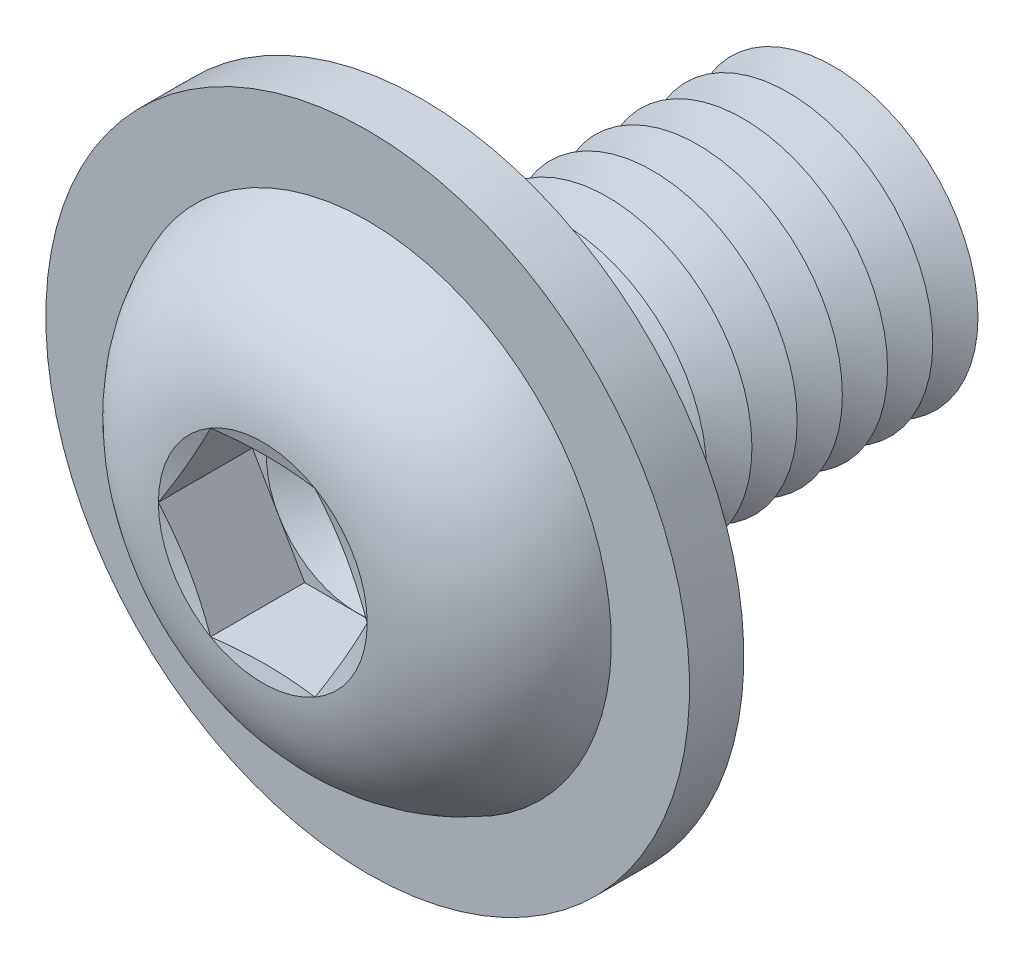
ISO-10303-21;
HEADER;
FILE_DESCRIPTION(('STEP AP214'),'2;1');
FILE_NAME('part.step','',(''),(''),'','','');
FILE_SCHEMA(('AUTOMOTIVE_DESIGN { 1 0 10303 214 1 1 1 1 }'));
ENDSEC;
DATA;
#1=APPLICATION_CONTEXT('core data for automotive mechanical design processes');
#2=APPLICATION_PROTOCOL_DEFINITION('international standard','automotive_design',2000,#1);
#3=PRODUCT_CONTEXT('',#1,'mechanical');
#4=PRODUCT('Part','Part','',(#3));
#5=PRODUCT_RELATED_PRODUCT_CATEGORY('part','',(#4));
#6=PRODUCT_DEFINITION_FORMATION('','',#4);
#7=PRODUCT_DEFINITION_CONTEXT('part definition',#1,'design');
#8=PRODUCT_DEFINITION('design','',#6,#7);
#9=PRODUCT_DEFINITION_SHAPE('','',#8);
#10=(LENGTH_UNIT() NAMED_UNIT(*) SI_UNIT(.MILLI.,.METRE.));
#11=(NAMED_UNIT(*) PLANE_ANGLE_UNIT() SI_UNIT($,.RADIAN.));
#12=(NAMED_UNIT(*) SI_UNIT($,.STERADIAN.) SOLID_ANGLE_UNIT());
#13=UNCERTAINTY_MEASURE_WITH_UNIT(LENGTH_MEASURE(1.E-05),#10,'distance_accuracy_value','');
#14=(GEOMETRIC_REPRESENTATION_CONTEXT(3) GLOBAL_UNCERTAINTY_ASSIGNED_CONTEXT((#13)) GLOBAL_UNIT_ASSIGNED_CONTEXT((#10,
#11,#12)) REPRESENTATION_CONTEXT('',''));
#15=CARTESIAN_POINT('',(0.,0.,0.));
#16=DIRECTION('',(0.,0.,1.));
#17=DIRECTION('',(1.,0.,0.));
#18=AXIS2_PLACEMENT_3D('',#15,#16,#17);
#19=CARTESIAN_POINT('',(0.,0.,-7.625));
#20=DIRECTION('',(0.,0.,1.));
#21=DIRECTION('',(1.,0.,0.));
#22=AXIS2_PLACEMENT_3D('',#19,#20,#21);
#23=CONICAL_SURFACE('',#22,4.,1.0471975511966);
#24=CARTESIAN_POINT('',(0.,0.,-8.25));
#25=DIRECTION('',(0.,0.,1.));
#26=DIRECTION('',(1.,0.,0.));
#27=AXIS2_PLACEMENT_3D('',#24,#25,#26);
#28=CIRCLE('',#27,2.91746824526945);
#29=CARTESIAN_POINT('',(2.91746824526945,0.,-8.25));
#30=VERTEX_POINT('',#29);
#31=EDGE_CURVE('E282',#30,#30,#28,.T.);
#32=ORIENTED_EDGE('',*,*,#31,.T.);
#33=EDGE_LOOP('',(#32));
#34=FACE_BOUND('',#33,.T.);
#35=CARTESIAN_POINT('',(0.,0.,-7.625));
#36=DIRECTION('',(0.,0.,1.));
#37=DIRECTION('',(1.,0.,0.));
#38=AXIS2_PLACEMENT_3D('',#35,#36,#37);
#39=CIRCLE('',#38,4.);
#40=CARTESIAN_POINT('',(4.,0.,-7.625));
#41=VERTEX_POINT('',#40);
#42=EDGE_CURVE('E278',#41,#41,#39,.T.);
#43=ORIENTED_EDGE('',*,*,#42,.F.);
#44=EDGE_LOOP('',(#43));
#45=FACE_BOUND('',#44,.T.);
#46=ADVANCED_FACE('F39',(#34,#45),#23,.T.);
#47=CARTESIAN_POINT('',(0.,0.,-8.25));
#48=DIRECTION('',(0.,0.,-1.));
#49=DIRECTION('',(-1.,0.,0.));
#50=AXIS2_PLACEMENT_3D('',#47,#48,#49);
#51=CONICAL_SURFACE('',#50,2.91746824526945,1.0471975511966);
#52=CARTESIAN_POINT('',(0.,0.,-8.875));
#53=DIRECTION('',(0.,0.,1.));
#54=DIRECTION('',(1.,0.,0.));
#55=AXIS2_PLACEMENT_3D('',#52,#53,#54);
#56=CIRCLE('',#55,4.);
#57=CARTESIAN_POINT('',(4.,0.,-8.875));
#58=VERTEX_POINT('',#57);
#59=EDGE_CURVE('E286',#58,#58,#56,.T.);
#60=ORIENTED_EDGE('',*,*,#59,.T.);
#61=EDGE_LOOP('',(#60));
#62=FACE_BOUND('',#61,.T.);
#63=ORIENTED_EDGE('',*,*,#31,.F.);
#64=EDGE_LOOP('',(#63));
#65=FACE_BOUND('',#64,.T.);
#66=ADVANCED_FACE('F419',(#62,#65),#51,.T.);
#67=CARTESIAN_POINT('',(0.,4.00000000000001,-12.));
#68=DIRECTION('',(0.,0.,-1.));
#69=DIRECTION('',(-1.,0.,0.));
#70=AXIS2_PLACEMENT_3D('',#67,#68,#69);
#71=PLANE('',#70);
#72=CARTESIAN_POINT('',(0.,0.,-12.));
#73=DIRECTION('',(0.,0.,1.));
#74=DIRECTION('',(1.,0.,0.));
#75=AXIS2_PLACEMENT_3D('',#72,#73,#74);
#76=CIRCLE('',#75,2.91746824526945);
#77=CARTESIAN_POINT('',(2.91746824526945,0.,-12.));
#78=VERTEX_POINT('',#77);
#79=EDGE_CURVE('E306',#78,#78,#76,.T.);
#80=ORIENTED_EDGE('',*,*,#79,.F.);
#81=EDGE_LOOP('',(#80));
#82=FACE_BOUND('',#81,.T.);
#83=ADVANCED_FACE('F425',(#82),#71,.T.);
#84=CARTESIAN_POINT('',(0.,0.,-11.375));
#85=DIRECTION('',(0.,0.,1.));
#86=DIRECTION('',(1.,0.,0.));
#87=AXIS2_PLACEMENT_3D('',#84,#85,#86);
#88=CONICAL_SURFACE('',#87,4.,1.0471975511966);
#89=ORIENTED_EDGE('',*,*,#79,.T.);
#90=EDGE_LOOP('',(#89));
#91=FACE_BOUND('',#90,.T.);
#92=CARTESIAN_POINT('',(0.,0.,-11.375));
#93=DIRECTION('',(0.,0.,1.));
#94=DIRECTION('',(1.,0.,0.));
#95=AXIS2_PLACEMENT_3D('',#92,#93,#94);
#96=CIRCLE('',#95,4.);
#97=CARTESIAN_POINT('',(4.,0.,-11.375));
#98=VERTEX_POINT('',#97);
#99=EDGE_CURVE('E302',#98,#98,#96,.T.);
#100=ORIENTED_EDGE('',*,*,#99,.F.);
#101=EDGE_LOOP('',(#100));
#102=FACE_BOUND('',#101,.T.);
#103=ADVANCED_FACE('F444',(#91,#102),#88,.T.);
#104=CARTESIAN_POINT('',(0.,0.,-10.75));
#105=DIRECTION('',(0.,0.,-1.));
#106=DIRECTION('',(-1.,0.,0.));
#107=AXIS2_PLACEMENT_3D('',#104,#105,#106);
#108=CONICAL_SURFACE('',#107,2.91746824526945,1.0471975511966);
#109=ORIENTED_EDGE('',*,*,#99,.T.);
#110=EDGE_LOOP('',(#109));
#111=FACE_BOUND('',#110,.T.);
#112=CARTESIAN_POINT('',(0.,0.,-10.75));
#113=DIRECTION('',(0.,0.,1.));
#114=DIRECTION('',(1.,0.,0.));
#115=AXIS2_PLACEMENT_3D('',#112,#113,#114);
#116=CIRCLE('',#115,2.91746824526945);
#117=CARTESIAN_POINT('',(2.91746824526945,0.,-10.75));
#118=VERTEX_POINT('',#117);
#119=EDGE_CURVE('E298',#118,#118,#116,.T.);
#120=ORIENTED_EDGE('',*,*,#119,.F.);
#121=EDGE_LOOP('',(#120));
#122=FACE_BOUND('',#121,.T.);
#123=ADVANCED_FACE('F441',(#111,#122),#108,.T.);
#124=CARTESIAN_POINT('',(0.,0.,-10.125));
#125=DIRECTION('',(0.,0.,1.));
#126=DIRECTION('',(1.,0.,0.));
#127=AXIS2_PLACEMENT_3D('',#124,#125,#126);
#128=CONICAL_SURFACE('',#127,4.,1.0471975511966);
#129=ORIENTED_EDGE('',*,*,#119,.T.);
#130=EDGE_LOOP('',(#129));
#131=FACE_BOUND('',#130,.T.);
#132=CARTESIAN_POINT('',(0.,0.,-10.125));
#133=DIRECTION('',(0.,0.,1.));
#134=DIRECTION('',(1.,0.,0.));
#135=AXIS2_PLACEMENT_3D('',#132,#133,#134);
#136=CIRCLE('',#135,4.);
#137=CARTESIAN_POINT('',(4.,0.,-10.125));
#138=VERTEX_POINT('',#137);
#139=EDGE_CURVE('E294',#138,#138,#136,.T.);
#140=ORIENTED_EDGE('',*,*,#139,.F.);
#141=EDGE_LOOP('',(#140));
#142=FACE_BOUND('',#141,.T.);
#143=ADVANCED_FACE('F435',(#131,#142),#128,.T.);
#144=CARTESIAN_POINT('',(0.,0.,-9.5));
#145=DIRECTION('',(0.,0.,-1.));
#146=DIRECTION('',(-1.,0.,0.));
#147=AXIS2_PLACEMENT_3D('',#144,#145,#146);
#148=CONICAL_SURFACE('',#147,2.91746824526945,1.0471975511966);
#149=ORIENTED_EDGE('',*,*,#139,.T.);
#150=EDGE_LOOP('',(#149));
#151=FACE_BOUND('',#150,.T.);
#152=CARTESIAN_POINT('',(0.,0.,-9.5));
#153=DIRECTION('',(0.,0.,1.));
#154=DIRECTION('',(1.,0.,0.));
#155=AXIS2_PLACEMENT_3D('',#152,#153,#154);
#156=CIRCLE('',#155,2.91746824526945);
#157=CARTESIAN_POINT('',(2.91746824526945,0.,-9.5));
#158=VERTEX_POINT('',#157);
#159=EDGE_CURVE('E290',#158,#158,#156,.T.);
#160=ORIENTED_EDGE('',*,*,#159,.F.);
#161=EDGE_LOOP('',(#160));
#162=FACE_BOUND('',#161,.T.);
#163=ADVANCED_FACE('F431',(#151,#162),#148,.T.);
#164=CARTESIAN_POINT('',(0.,0.,-8.875));
#165=DIRECTION('',(0.,0.,1.));
#166=DIRECTION('',(1.,0.,0.));
#167=AXIS2_PLACEMENT_3D('',#164,#165,#166);
#168=CONICAL_SURFACE('',#167,4.,1.0471975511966);
#169=ORIENTED_EDGE('',*,*,#159,.T.);
#170=EDGE_LOOP('',(#169));
#171=FACE_BOUND('',#170,.T.);
#172=ORIENTED_EDGE('',*,*,#59,.F.);
#173=EDGE_LOOP('',(#172));
#174=FACE_BOUND('',#173,.T.);
#175=ADVANCED_FACE('F434',(#171,#174),#168,.T.);
#176=CARTESIAN_POINT('',(0.,0.,-6.375));
#177=DIRECTION('',(0.,0.,1.));
#178=DIRECTION('',(1.,0.,0.));
#179=AXIS2_PLACEMENT_3D('',#176,#177,#178);
#180=CONICAL_SURFACE('',#179,4.,1.0471975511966);
#181=CARTESIAN_POINT('',(0.,0.,-7.));
#182=DIRECTION('',(0.,0.,1.));
#183=DIRECTION('',(1.,0.,0.));
#184=AXIS2_PLACEMENT_3D('',#181,#182,#183);
#185=CIRCLE('',#184,2.91746824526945);
#186=CARTESIAN_POINT('',(2.91746824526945,0.,-7.));
#187=VERTEX_POINT('',#186);
#188=EDGE_CURVE('E274',#187,#187,#185,.T.);
#189=ORIENTED_EDGE('',*,*,#188,.T.);
#190=EDGE_LOOP('',(#189));
#191=FACE_BOUND('',#190,.T.);
#192=CARTESIAN_POINT('',(0.,0.,-6.375));
#193=DIRECTION('',(0.,0.,1.));
#194=DIRECTION('',(1.,0.,0.));
#195=AXIS2_PLACEMENT_3D('',#192,#193,#194);
#196=CIRCLE('',#195,4.);
#197=CARTESIAN_POINT('',(4.,0.,-6.375));
#198=VERTEX_POINT('',#197);
#199=EDGE_CURVE('E270',#198,#198,#196,.T.);
#200=ORIENTED_EDGE('',*,*,#199,.F.);
#201=EDGE_LOOP('',(#200));
#202=FACE_BOUND('',#201,.T.);
#203=ADVANCED_FACE('F439',(#191,#202),#180,.T.);
#204=CARTESIAN_POINT('',(0.,0.,-7.));
#205=DIRECTION('',(0.,0.,-1.));
#206=DIRECTION('',(-1.,0.,0.));
#207=AXIS2_PLACEMENT_3D('',#204,#205,#206);
#208=CONICAL_SURFACE('',#207,2.91746824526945,1.0471975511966);
#209=ORIENTED_EDGE('',*,*,#42,.T.);
#210=EDGE_LOOP('',(#209));
#211=FACE_BOUND('',#210,.T.);
#212=ORIENTED_EDGE('',*,*,#188,.F.);
#213=EDGE_LOOP('',(#212));
#214=FACE_BOUND('',#213,.T.);
#215=ADVANCED_FACE('F490',(#211,#214),#208,.T.);
#216=CARTESIAN_POINT('',(0.,0.,-5.125));
#217=DIRECTION('',(0.,0.,1.));
#218=DIRECTION('',(1.,0.,0.));
#219=AXIS2_PLACEMENT_3D('',#216,#217,#218);
#220=CONICAL_SURFACE('',#219,4.,1.0471975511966);
#221=CARTESIAN_POINT('',(0.,0.,-5.75));
#222=DIRECTION('',(0.,0.,1.));
#223=DIRECTION('',(1.,0.,0.));
#224=AXIS2_PLACEMENT_3D('',#221,#222,#223);
#225=CIRCLE('',#224,2.91746824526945);
#226=CARTESIAN_POINT('',(2.91746824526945,0.,-5.75));
#227=VERTEX_POINT('',#226);
#228=EDGE_CURVE('E266',#227,#227,#225,.T.);
#229=ORIENTED_EDGE('',*,*,#228,.T.);
#230=EDGE_LOOP('',(#229));
#231=FACE_BOUND('',#230,.T.);
#232=CARTESIAN_POINT('',(0.,0.,-5.125));
#233=DIRECTION('',(0.,0.,1.));
#234=DIRECTION('',(1.,0.,0.));
#235=AXIS2_PLACEMENT_3D('',#232,#233,#234);
#236=CIRCLE('',#235,4.);
#237=CARTESIAN_POINT('',(4.,0.,-5.125));
#238=VERTEX_POINT('',#237);
#239=EDGE_CURVE('E262',#238,#238,#236,.T.);
#240=ORIENTED_EDGE('',*,*,#239,.F.);
#241=EDGE_LOOP('',(#240));
#242=FACE_BOUND('',#241,.T.);
#243=ADVANCED_FACE('F496',(#231,#242),#220,.T.);
#244=CARTESIAN_POINT('',(0.,0.,-5.75));
#245=DIRECTION('',(0.,0.,-1.));
#246=DIRECTION('',(-1.,0.,0.));
#247=AXIS2_PLACEMENT_3D('',#244,#245,#246);
#248=CONICAL_SURFACE('',#247,2.91746824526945,1.0471975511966);
#249=ORIENTED_EDGE('',*,*,#199,.T.);
#250=EDGE_LOOP('',(#249));
#251=FACE_BOUND('',#250,.T.);
#252=ORIENTED_EDGE('',*,*,#228,.F.);
#253=EDGE_LOOP('',(#252));
#254=FACE_BOUND('',#253,.T.);
#255=ADVANCED_FACE('F503',(#251,#254),#248,.T.);
#256=CARTESIAN_POINT('',(0.,0.,-3.875));
#257=DIRECTION('',(0.,0.,1.));
#258=DIRECTION('',(1.,0.,0.));
#259=AXIS2_PLACEMENT_3D('',#256,#257,#258);
#260=CONICAL_SURFACE('',#259,4.,1.0471975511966);
#261=CARTESIAN_POINT('',(0.,0.,-4.5));
#262=DIRECTION('',(0.,0.,1.));
#263=DIRECTION('',(1.,0.,0.));
#264=AXIS2_PLACEMENT_3D('',#261,#262,#263);
#265=CIRCLE('',#264,2.91746824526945);
#266=CARTESIAN_POINT('',(2.91746824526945,0.,-4.5));
#267=VERTEX_POINT('',#266);
#268=EDGE_CURVE('E258',#267,#267,#265,.T.);
#269=ORIENTED_EDGE('',*,*,#268,.T.);
#270=EDGE_LOOP('',(#269));
#271=FACE_BOUND('',#270,.T.);
#272=CARTESIAN_POINT('',(0.,0.,-3.875));
#273=DIRECTION('',(0.,0.,1.));
#274=DIRECTION('',(1.,0.,0.));
#275=AXIS2_PLACEMENT_3D('',#272,#273,#274);
#276=CIRCLE('',#275,4.);
#277=CARTESIAN_POINT('',(4.,0.,-3.875));
#278=VERTEX_POINT('',#277);
#279=EDGE_CURVE('E254',#278,#278,#276,.T.);
#280=ORIENTED_EDGE('',*,*,#279,.F.);
#281=EDGE_LOOP('',(#280));
#282=FACE_BOUND('',#281,.T.);
#283=ADVANCED_FACE('F510',(#271,#282),#260,.T.);
#284=CARTESIAN_POINT('',(0.,0.,-4.5));
#285=DIRECTION('',(0.,0.,-1.));
#286=DIRECTION('',(-1.,0.,0.));
#287=AXIS2_PLACEMENT_3D('',#284,#285,#286);
#288=CONICAL_SURFACE('',#287,2.91746824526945,1.0471975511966);
#289=ORIENTED_EDGE('',*,*,#239,.T.);
#290=EDGE_LOOP('',(#289));
#291=FACE_BOUND('',#290,.T.);
#292=ORIENTED_EDGE('',*,*,#268,.F.);
#293=EDGE_LOOP('',(#292));
#294=FACE_BOUND('',#293,.T.);
#295=ADVANCED_FACE('F517',(#291,#294),#288,.T.);
#296=CARTESIAN_POINT('',(0.,0.,-2.625));
#297=DIRECTION('',(0.,0.,1.));
#298=DIRECTION('',(1.,0.,0.));
#299=AXIS2_PLACEMENT_3D('',#296,#297,#298);
#300=CONICAL_SURFACE('',#299,4.,1.0471975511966);
#301=CARTESIAN_POINT('',(0.,0.,-3.25));
#302=DIRECTION('',(0.,0.,1.));
#303=DIRECTION('',(1.,0.,0.));
#304=AXIS2_PLACEMENT_3D('',#301,#302,#303);
#305=CIRCLE('',#304,2.91746824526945);
#306=CARTESIAN_POINT('',(2.91746824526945,0.,-3.25));
#307=VERTEX_POINT('',#306);
#308=EDGE_CURVE('E250',#307,#307,#305,.T.);
#309=ORIENTED_EDGE('',*,*,#308,.T.);
#310=EDGE_LOOP('',(#309));
#311=FACE_BOUND('',#310,.T.);
#312=CARTESIAN_POINT('',(0.,0.,-2.625));
#313=DIRECTION('',(0.,0.,1.));
#314=DIRECTION('',(1.,0.,0.));
#315=AXIS2_PLACEMENT_3D('',#312,#313,#314);
#316=CIRCLE('',#315,4.);
#317=CARTESIAN_POINT('',(4.,0.,-2.625));
#318=VERTEX_POINT('',#317);
#319=EDGE_CURVE('E242',#318,#318,#316,.T.);
#320=ORIENTED_EDGE('',*,*,#319,.F.);
#321=EDGE_LOOP('',(#320));
#322=FACE_BOUND('',#321,.T.);
#323=ADVANCED_FACE('F524',(#311,#322),#300,.T.);
#324=CARTESIAN_POINT('',(0.,0.,-3.25));
#325=DIRECTION('',(0.,0.,-1.));
#326=DIRECTION('',(-1.,0.,0.));
#327=AXIS2_PLACEMENT_3D('',#324,#325,#326);
#328=CONICAL_SURFACE('',#327,2.91746824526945,1.0471975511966);
#329=ORIENTED_EDGE('',*,*,#279,.T.);
#330=EDGE_LOOP('',(#329));
#331=FACE_BOUND('',#330,.T.);
#332=ORIENTED_EDGE('',*,*,#308,.F.);
#333=EDGE_LOOP('',(#332));
#334=FACE_BOUND('',#333,.T.);
#335=ADVANCED_FACE('F531',(#331,#334),#328,.T.);
#336=CARTESIAN_POINT('',(0.,0.,-1.375));
#337=DIRECTION('',(0.,0.,1.));
#338=DIRECTION('',(1.,0.,0.));
#339=AXIS2_PLACEMENT_3D('',#336,#337,#338);
#340=CONICAL_SURFACE('',#339,4.,1.0471975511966);
#341=CARTESIAN_POINT('',(0.,0.,-2.));
#342=DIRECTION('',(0.,0.,1.));
#343=DIRECTION('',(1.,0.,0.));
#344=AXIS2_PLACEMENT_3D('',#341,#342,#343);
#345=CIRCLE('',#344,2.91746824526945);
#346=CARTESIAN_POINT('',(2.91746824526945,0.,-2.));
#347=VERTEX_POINT('',#346);
#348=EDGE_CURVE('E231',#347,#347,#345,.T.);
#349=ORIENTED_EDGE('',*,*,#348,.T.);
#350=EDGE_LOOP('',(#349));
#351=FACE_BOUND('',#350,.T.);
#352=CARTESIAN_POINT('',(0.,0.,-1.375));
#353=DIRECTION('',(0.,0.,1.));
#354=DIRECTION('',(1.,0.,0.));
#355=AXIS2_PLACEMENT_3D('',#352,#353,#354);
#356=CIRCLE('',#355,4.);
#357=CARTESIAN_POINT('',(4.,0.,-1.375));
#358=VERTEX_POINT('',#357);
#359=EDGE_CURVE('E246',#358,#358,#356,.T.);
#360=ORIENTED_EDGE('',*,*,#359,.F.);
#361=EDGE_LOOP('',(#360));
#362=FACE_BOUND('',#361,.T.);
#363=ADVANCED_FACE('F538',(#351,#362),#340,.T.);
#364=CARTESIAN_POINT('',(0.,0.,-2.));
#365=DIRECTION('',(0.,0.,-1.));
#366=DIRECTION('',(-1.,0.,0.));
#367=AXIS2_PLACEMENT_3D('',#364,#365,#366);
#368=CONICAL_SURFACE('',#367,2.91746824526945,1.0471975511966);
#369=ORIENTED_EDGE('',*,*,#319,.T.);
#370=EDGE_LOOP('',(#369));
#371=FACE_BOUND('',#370,.T.);
#372=ORIENTED_EDGE('',*,*,#348,.F.);
#373=EDGE_LOOP('',(#372));
#374=FACE_BOUND('',#373,.T.);
#375=ADVANCED_FACE('F220',(#371,#374),#368,.T.);
#376=CARTESIAN_POINT('',(0.,4.,0.));
#377=DIRECTION('',(0.,0.,-1.));
#378=DIRECTION('',(-1.,0.,0.));
#379=AXIS2_PLACEMENT_3D('',#376,#377,#378);
#380=PLANE('',#379);
#381=CARTESIAN_POINT('',(0.,0.,0.));
#382=DIRECTION('',(0.,0.,-1.));
#383=DIRECTION('',(-1.,0.,0.));
#384=AXIS2_PLACEMENT_3D('',#381,#382,#383);
#385=CIRCLE('',#384,4.625);
#386=CARTESIAN_POINT('',(-4.625,0.,0.));
#387=VERTEX_POINT('',#386);
#388=EDGE_CURVE('E320',#387,#387,#385,.F.);
#389=ORIENTED_EDGE('',*,*,#388,.T.);
#390=EDGE_LOOP('',(#389));
#391=FACE_BOUND('',#390,.T.);
#392=CARTESIAN_POINT('',(0.,0.,0.));
#393=DIRECTION('',(0.,0.,-1.));
#394=DIRECTION('',(0.,1.,0.));
#395=AXIS2_PLACEMENT_3D('',#392,#393,#394);
#396=CIRCLE('',#395,8.9);
#397=CARTESIAN_POINT('',(0.,8.9,0.));
#398=VERTEX_POINT('',#397);
#399=EDGE_CURVE('E837',#398,#398,#396,.T.);
#400=ORIENTED_EDGE('',*,*,#399,.T.);
#401=EDGE_LOOP('',(#400));
#402=FACE_BOUND('',#401,.T.);
#403=ADVANCED_FACE('F550',(#391,#402),#380,.T.);
#404=CARTESIAN_POINT('',(0.,0.,-0.624999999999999));
#405=DIRECTION('',(0.,0.,-1.));
#406=DIRECTION('',(-1.,0.,0.));
#407=AXIS2_PLACEMENT_3D('',#404,#405,#406);
#408=TOROIDAL_SURFACE('',#407,4.625,0.625);
#409=ORIENTED_EDGE('',*,*,#388,.F.);
#410=EDGE_LOOP('',(#409));
#411=FACE_BOUND('',#410,.T.);
#412=CARTESIAN_POINT('',(0.,0.,-0.624999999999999));
#413=DIRECTION('',(0.,0.,-1.));
#414=DIRECTION('',(-1.,0.,0.));
#415=AXIS2_PLACEMENT_3D('',#412,#413,#414);
#416=CIRCLE('',#415,4.);
#417=CARTESIAN_POINT('',(-4.,0.,-0.624999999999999));
#418=VERTEX_POINT('',#417);
#419=EDGE_CURVE('E315',#418,#418,#416,.T.);
#420=ORIENTED_EDGE('',*,*,#419,.F.);
#421=EDGE_LOOP('',(#420));
#422=FACE_BOUND('',#421,.T.);
#423=ADVANCED_FACE('F41',(#411,#422),#408,.F.);
#424=CARTESIAN_POINT('',(0.,0.,-12.));
#425=DIRECTION('',(0.,0.,-1.));
#426=DIRECTION('',(-1.,0.,0.));
#427=AXIS2_PLACEMENT_3D('',#424,#425,#426);
#428=CYLINDRICAL_SURFACE('',#427,4.);
#429=ORIENTED_EDGE('',*,*,#419,.T.);
#430=EDGE_LOOP('',(#429));
#431=FACE_BOUND('',#430,.T.);
#432=ORIENTED_EDGE('',*,*,#359,.T.);
#433=EDGE_LOOP('',(#432));
#434=FACE_BOUND('',#433,.T.);
#435=ADVANCED_FACE('F562',(#431,#434),#428,.T.);
#436=CARTESIAN_POINT('',(0.,0.,1.5));
#437=DIRECTION('',(0.,0.,-1.));
#438=DIRECTION('',(0.,1.,0.));
#439=AXIS2_PLACEMENT_3D('',#436,#437,#438);
#440=CYLINDRICAL_SURFACE('',#439,8.9);
#441=CARTESIAN_POINT('',(0.,0.,1.5));
#442=DIRECTION('',(0.,0.,-1.));
#443=DIRECTION('',(0.,1.,0.));
#444=AXIS2_PLACEMENT_3D('',#441,#442,#443);
#445=CIRCLE('',#444,8.9);
#446=CARTESIAN_POINT('',(0.,8.9,1.5));
#447=VERTEX_POINT('',#446);
#448=EDGE_CURVE('E839',#447,#447,#445,.T.);
#449=ORIENTED_EDGE('',*,*,#448,.T.);
#450=EDGE_LOOP('',(#449));
#451=FACE_BOUND('',#450,.T.);
#452=ORIENTED_EDGE('',*,*,#399,.F.);
#453=EDGE_LOOP('',(#452));
#454=FACE_BOUND('',#453,.T.);
#455=ADVANCED_FACE('F568',(#451,#454),#440,.T.);
#456=CARTESIAN_POINT('',(0.,0.,1.5));
#457=DIRECTION('',(0.,0.,-1.));
#458=DIRECTION('',(0.,1.,0.));
#459=AXIS2_PLACEMENT_3D('',#456,#457,#458);
#460=PLANE('',#459);
#461=CARTESIAN_POINT('',(0.,0.,1.5));
#462=DIRECTION('',(0.,0.,-1.));
#463=DIRECTION('',(0.,1.,0.));
#464=AXIS2_PLACEMENT_3D('',#461,#462,#463);
#465=CIRCLE('',#464,6.73705889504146);
#466=CARTESIAN_POINT('',(0.,6.73705889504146,1.5));
#467=VERTEX_POINT('',#466);
#468=EDGE_CURVE('E43',#467,#467,#465,.F.);
#469=ORIENTED_EDGE('',*,*,#468,.F.);
#470=EDGE_LOOP('',(#469));
#471=FACE_BOUND('',#470,.T.);
#472=ORIENTED_EDGE('',*,*,#448,.F.);
#473=EDGE_LOOP('',(#472));
#474=FACE_BOUND('',#473,.T.);
#475=ADVANCED_FACE('F117',(#471,#474),#460,.F.);
#476=CARTESIAN_POINT('',(0.,0.,1.8));
#477=DIRECTION('',(0.,0.,1.));
#478=DIRECTION('',(1.,0.,0.));
#479=AXIS2_PLACEMENT_3D('',#476,#477,#478);
#480=CONICAL_SURFACE('',#479,2.49999883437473,1.0471975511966);
#481=CARTESIAN_POINT('',(0.,0.,0.35662500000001));
#482=VERTEX_POINT('',#481);
#483=VERTEX_LOOP('',#482);
#484=FACE_BOUND('',#483,.T.);
#485=CARTESIAN_POINT('',(0.,0.,1.8));
#486=DIRECTION('',(0.,0.,1.));
#487=DIRECTION('',(1.,0.,0.));
#488=AXIS2_PLACEMENT_3D('',#485,#486,#487);
#489=CIRCLE('',#488,2.49999883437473);
#490=CARTESIAN_POINT('',(2.1650625,1.24999941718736,1.8));
#491=VERTEX_POINT('',#490);
#492=CARTESIAN_POINT('',(0.,2.49999883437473,1.8));
#493=VERTEX_POINT('',#492);
#494=EDGE_CURVE('E120',#491,#493,#489,.T.);
#495=ORIENTED_EDGE('',*,*,#494,.T.);
#496=CARTESIAN_POINT('',(0.,0.,1.8));
#497=DIRECTION('',(0.,0.,1.));
#498=DIRECTION('',(1.,0.,0.));
#499=AXIS2_PLACEMENT_3D('',#496,#497,#498);
#500=CIRCLE('',#499,2.49999883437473);
#501=CARTESIAN_POINT('',(-2.1650625,1.24999941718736,1.8));
#502=VERTEX_POINT('',#501);
#503=EDGE_CURVE('E11',#493,#502,#500,.T.);
#504=ORIENTED_EDGE('',*,*,#503,.T.);
#505=CARTESIAN_POINT('',(-2.1650625,-1.24999941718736,1.8));
#506=VERTEX_POINT('',#505);
#507=EDGE_CURVE('E49',#502,#506,#500,.T.);
#508=ORIENTED_EDGE('',*,*,#507,.T.);
#509=CARTESIAN_POINT('',(0.,-2.49999883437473,1.8));
#510=VERTEX_POINT('',#509);
#511=EDGE_CURVE('E326',#506,#510,#500,.T.);
#512=ORIENTED_EDGE('',*,*,#511,.T.);
#513=CARTESIAN_POINT('',(2.1650625,-1.24999941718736,1.8));
#514=VERTEX_POINT('',#513);
#515=EDGE_CURVE('E57',#510,#514,#500,.T.);
#516=ORIENTED_EDGE('',*,*,#515,.T.);
#517=EDGE_CURVE('E50',#514,#491,#500,.T.);
#518=ORIENTED_EDGE('',*,*,#517,.T.);
#519=EDGE_LOOP('',(#495,#504,#508,#512,#516,#518));
#520=FACE_BOUND('',#519,.T.);
#521=ADVANCED_FACE('F114',(#484,#520),#480,.F.);
#522=CARTESIAN_POINT('',(0.,0.,1.8));
#523=DIRECTION('',(0.,0.,1.));
#524=DIRECTION('',(1.,0.,0.));
#525=AXIS2_PLACEMENT_3D('',#522,#523,#524);
#526=PLANE('',#525);
#527=ORIENTED_EDGE('',*,*,#511,.F.);
#528=DIRECTION('',(0.5,-0.866025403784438,0.));
#529=VECTOR('',#528,1.);
#530=CARTESIAN_POINT('',(-2.88675,0.,1.8));
#531=LINE('',#530,#529);
#532=CARTESIAN_POINT('',(-1.443375,-2.49999883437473,1.8));
#533=VERTEX_POINT('',#532);
#534=EDGE_CURVE('E154',#506,#533,#531,.T.);
#535=ORIENTED_EDGE('',*,*,#534,.T.);
#536=DIRECTION('',(1.,0.,0.));
#537=VECTOR('',#536,1.);
#538=CARTESIAN_POINT('',(-1.443375,-2.49999883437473,1.8));
#539=LINE('',#538,#537);
#540=EDGE_CURVE('E160',#533,#510,#539,.T.);
#541=ORIENTED_EDGE('',*,*,#540,.T.);
#542=EDGE_LOOP('',(#527,#535,#541));
#543=FACE_BOUND('',#542,.T.);
#544=ADVANCED_FACE('F116',(#543),#526,.T.);
#545=ORIENTED_EDGE('',*,*,#515,.F.);
#546=CARTESIAN_POINT('',(1.443375,-2.49999883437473,1.8));
#547=VERTEX_POINT('',#546);
#548=EDGE_CURVE('E159',#510,#547,#539,.T.);
#549=ORIENTED_EDGE('',*,*,#548,.T.);
#550=DIRECTION('',(0.5,0.866025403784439,0.));
#551=VECTOR('',#550,1.);
#552=CARTESIAN_POINT('',(1.443375,-2.49999883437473,1.8));
#553=LINE('',#552,#551);
#554=EDGE_CURVE('E165',#547,#514,#553,.T.);
#555=ORIENTED_EDGE('',*,*,#554,.T.);
#556=EDGE_LOOP('',(#545,#549,#555));
#557=FACE_BOUND('',#556,.T.);
#558=ADVANCED_FACE('F589',(#557),#526,.T.);
#559=ORIENTED_EDGE('',*,*,#517,.F.);
#560=CARTESIAN_POINT('',(2.88675,0.,1.8));
#561=VERTEX_POINT('',#560);
#562=EDGE_CURVE('E164',#514,#561,#553,.T.);
#563=ORIENTED_EDGE('',*,*,#562,.T.);
#564=DIRECTION('',(-0.5,0.866025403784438,0.));
#565=VECTOR('',#564,1.);
#566=CARTESIAN_POINT('',(2.88675,0.,1.8));
#567=LINE('',#566,#565);
#568=EDGE_CURVE('E142',#561,#491,#567,.T.);
#569=ORIENTED_EDGE('',*,*,#568,.T.);
#570=EDGE_LOOP('',(#559,#563,#569));
#571=FACE_BOUND('',#570,.T.);
#572=ADVANCED_FACE('F383',(#571),#526,.T.);
#573=ORIENTED_EDGE('',*,*,#494,.F.);
#574=CARTESIAN_POINT('',(1.443375,2.49999883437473,1.8));
#575=VERTEX_POINT('',#574);
#576=EDGE_CURVE('E127',#491,#575,#567,.T.);
#577=ORIENTED_EDGE('',*,*,#576,.T.);
#578=DIRECTION('',(-1.,0.,0.));
#579=VECTOR('',#578,1.);
#580=CARTESIAN_POINT('',(1.443375,2.49999883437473,1.8));
#581=LINE('',#580,#579);
#582=EDGE_CURVE('E138',#575,#493,#581,.T.);
#583=ORIENTED_EDGE('',*,*,#582,.T.);
#584=EDGE_LOOP('',(#573,#577,#583));
#585=FACE_BOUND('',#584,.T.);
#586=ADVANCED_FACE('F144',(#585),#526,.T.);
#587=ORIENTED_EDGE('',*,*,#503,.F.);
#588=CARTESIAN_POINT('',(-1.443375,2.49999883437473,1.8));
#589=VERTEX_POINT('',#588);
#590=EDGE_CURVE('E133',#493,#589,#581,.T.);
#591=ORIENTED_EDGE('',*,*,#590,.T.);
#592=DIRECTION('',(-0.5,-0.866025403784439,0.));
#593=VECTOR('',#592,1.);
#594=CARTESIAN_POINT('',(-1.443375,2.49999883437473,1.8));
#595=LINE('',#594,#593);
#596=EDGE_CURVE('E136',#589,#502,#595,.T.);
#597=ORIENTED_EDGE('',*,*,#596,.T.);
#598=EDGE_LOOP('',(#587,#591,#597));
#599=FACE_BOUND('',#598,.T.);
#600=ADVANCED_FACE('F132',(#599),#526,.T.);
#601=ORIENTED_EDGE('',*,*,#507,.F.);
#602=CARTESIAN_POINT('',(-2.88675,0.,1.8));
#603=VERTEX_POINT('',#602);
#604=EDGE_CURVE('E146',#502,#603,#595,.T.);
#605=ORIENTED_EDGE('',*,*,#604,.T.);
#606=EDGE_CURVE('E155',#603,#506,#531,.T.);
#607=ORIENTED_EDGE('',*,*,#606,.T.);
#608=EDGE_LOOP('',(#601,#605,#607));
#609=FACE_BOUND('',#608,.T.);
#610=ADVANCED_FACE('F340',(#609),#526,.T.);
#611=CARTESIAN_POINT('',(-2.88675,0.,1.8));
#612=DIRECTION('',(-0.866025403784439,-0.5,0.));
#613=DIRECTION('',(0.5,-0.866025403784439,0.));
#614=AXIS2_PLACEMENT_3D('',#611,#612,#613);
#615=PLANE('',#614);
#616=CARTESIAN_POINT('',(-2.88686547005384,0.000200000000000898,4.40003094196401));
#617=CARTESIAN_POINT('',(-2.82691617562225,-0.103635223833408,4.3839595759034));
#618=CARTESIAN_POINT('',(-2.76685817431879,-0.207658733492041,4.36936933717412));
#619=CARTESIAN_POINT('',(-2.64653003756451,-0.416073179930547,4.3437355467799));
#620=CARTESIAN_POINT('',(-2.58625982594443,-0.520464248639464,4.33269343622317));
#621=CARTESIAN_POINT('',(-2.46587274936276,-0.728980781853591,4.31480063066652));
#622=CARTESIAN_POINT('',(-2.40575669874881,-0.833104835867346,4.3079285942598));
#623=CARTESIAN_POINT('',(-2.28544792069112,-1.0414857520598,4.29871388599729));
#624=CARTESIAN_POINT('',(-2.22525521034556,-1.14574258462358,4.29637033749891));
#625=CARTESIAN_POINT('',(-2.10486978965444,-1.35425624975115,4.29637033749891));
#626=CARTESIAN_POINT('',(-2.04467707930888,-1.45851308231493,4.29871388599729));
#627=CARTESIAN_POINT('',(-1.92436830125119,-1.66689399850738,4.3079285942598));
#628=CARTESIAN_POINT('',(-1.86425225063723,-1.77101805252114,4.31480063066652));
#629=CARTESIAN_POINT('',(-1.74386517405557,-1.97953458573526,4.33269343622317));
#630=CARTESIAN_POINT('',(-1.68359496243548,-2.08392565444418,4.3437355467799));
#631=CARTESIAN_POINT('',(-1.56326682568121,-2.29234010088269,4.36936933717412));
#632=CARTESIAN_POINT('',(-1.50320882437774,-2.39636361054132,4.3839595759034));
#633=CARTESIAN_POINT('',(-1.44325952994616,-2.50019883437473,4.40003094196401));
#634=B_SPLINE_CURVE_WITH_KNOTS('',3,(#616,#617,#618,#619,#620,#621,#622,#623,#624,#625,#626,
#627,#628,#629,#630,#631,#632,#633),.UNSPECIFIED.,.F.,.F.,(4,2,2,2,2,2,2,2,4),(0.,
0.362931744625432,0.726010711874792,1.08721550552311,1.44835036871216,1.8094852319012,
2.17069002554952,2.53376899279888,2.89670073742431),.UNSPECIFIED.);
#635=CARTESIAN_POINT('',(-2.88675,0.,4.4));
#636=VERTEX_POINT('',#635);
#637=CARTESIAN_POINT('',(-1.443375,-2.49999883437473,4.4));
#638=VERTEX_POINT('',#637);
#639=EDGE_CURVE('E345',#636,#638,#634,.T.);
#640=ORIENTED_EDGE('',*,*,#639,.T.);
#641=DIRECTION('',(0.,0.,1.));
#642=VECTOR('',#641,1.);
#643=CARTESIAN_POINT('',(-1.443375,-2.49999883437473,1.8));
#644=LINE('',#643,#642);
#645=EDGE_CURVE('E177',#533,#638,#644,.T.);
#646=ORIENTED_EDGE('',*,*,#645,.F.);
#647=ORIENTED_EDGE('',*,*,#534,.F.);
#648=ORIENTED_EDGE('',*,*,#606,.F.);
#649=DIRECTION('',(0.,0.,1.));
#650=VECTOR('',#649,1.);
#651=CARTESIAN_POINT('',(-2.88675,0.,1.8));
#652=LINE('',#651,#650);
#653=EDGE_CURVE('E181',#603,#636,#652,.T.);
#654=ORIENTED_EDGE('',*,*,#653,.T.);
#655=EDGE_LOOP('',(#640,#646,#647,#648,#654));
#656=FACE_BOUND('',#655,.T.);
#657=ADVANCED_FACE('F338',(#656),#615,.F.);
#658=CARTESIAN_POINT('',(-1.443375,-2.49999883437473,1.8));
#659=DIRECTION('',(0.,-1.,0.));
#660=DIRECTION('',(1.,0.,0.));
#661=AXIS2_PLACEMENT_3D('',#658,#659,#660);
#662=PLANE('',#661);
#663=CARTESIAN_POINT('',(-4.35611719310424,-2.49999883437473,4.97227902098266));
#664=CARTESIAN_POINT('',(-4.25066509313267,-2.49999883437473,4.94777440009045));
#665=CARTESIAN_POINT('',(-4.14516541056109,-2.49999883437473,4.92347459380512));
#666=CARTESIAN_POINT('',(-3.93405094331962,-2.49999883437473,4.87537247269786));
#667=CARTESIAN_POINT('',(-3.82843615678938,-2.49999883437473,4.85157016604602));
#668=CARTESIAN_POINT('',(-3.5113534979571,-2.49999883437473,4.78103338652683));
#669=CARTESIAN_POINT('',(-3.29968815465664,-2.49999883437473,4.73517861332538));
#670=CARTESIAN_POINT('',(-2.87365524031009,-2.49999883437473,4.64645582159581));
#671=CARTESIAN_POINT('',(-2.65928093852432,-2.49999883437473,4.60361983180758));
#672=CARTESIAN_POINT('',(-2.22952626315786,-2.49999883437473,4.52311285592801));
#673=CARTESIAN_POINT('',(-2.01414580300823,-2.49999883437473,4.48544232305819));
#674=CARTESIAN_POINT('',(-1.58798319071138,-2.49999883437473,4.41876559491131));
#675=CARTESIAN_POINT('',(-1.37723418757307,-2.49999883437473,4.38955265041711));
#676=CARTESIAN_POINT('',(-0.954530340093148,-2.49999883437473,4.34171384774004));
#677=CARTESIAN_POINT('',(-0.742575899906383,-2.49999883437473,4.32308463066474));
#678=CARTESIAN_POINT('',(-0.424544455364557,-2.49999883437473,4.30539140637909));
#679=CARTESIAN_POINT('',(-0.318745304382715,-2.49999883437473,4.30120018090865));
#680=CARTESIAN_POINT('',(-0.107062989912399,-2.49999883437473,4.29638997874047));
#681=CARTESIAN_POINT('',(-0.00117982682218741,-2.49999883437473,4.29577098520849));
#682=CARTESIAN_POINT('',(0.210552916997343,-2.49999883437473,4.29814378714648));
#683=CARTESIAN_POINT('',(0.316402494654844,-2.49999883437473,4.30113585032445));
#684=CARTESIAN_POINT('',(0.527944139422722,-2.49999883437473,4.31057322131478));
#685=CARTESIAN_POINT('',(0.633636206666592,-2.49999883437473,4.31701852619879));
#686=CARTESIAN_POINT('',(0.890304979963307,-2.49999883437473,4.33652018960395));
#687=CARTESIAN_POINT('',(1.0411561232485,-2.49999883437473,4.35122885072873));
#688=CARTESIAN_POINT('',(1.34222474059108,-2.49999883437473,4.38593609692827));
#689=CARTESIAN_POINT('',(1.49244223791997,-2.49999883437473,4.40593448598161));
#690=CARTESIAN_POINT('',(1.79273634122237,-2.49999883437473,4.45011321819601));
#691=CARTESIAN_POINT('',(1.94281100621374,-2.49999883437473,4.47430656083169));
#692=CARTESIAN_POINT('',(2.24242097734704,-2.49999883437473,4.52583552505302));
#693=CARTESIAN_POINT('',(2.39195625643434,-2.49999883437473,4.55317130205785));
#694=CARTESIAN_POINT('',(2.69364402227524,-2.49999883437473,4.61079781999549));
#695=CARTESIAN_POINT('',(2.8457870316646,-2.49999883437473,4.64113779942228));
#696=CARTESIAN_POINT('',(3.14969016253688,-2.49999883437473,4.70367638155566));
#697=CARTESIAN_POINT('',(3.30145027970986,-2.49999883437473,4.73587500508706));
#698=CARTESIAN_POINT('',(3.60383766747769,-2.49999883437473,4.80150275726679));
#699=CARTESIAN_POINT('',(3.75446660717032,-2.49999883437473,4.83492423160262));
#700=CARTESIAN_POINT('',(4.05546753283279,-2.49999883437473,4.90285814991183));
#701=CARTESIAN_POINT('',(4.2058395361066,-2.49999883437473,4.9373705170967));
#702=CARTESIAN_POINT('',(4.35611719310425,-2.49999883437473,4.97227902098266));
#703=B_SPLINE_CURVE_WITH_KNOTS('',3,(#663,#664,#665,#666,#667,#668,#669,#670,#671,#672,#673,
#674,#675,#676,#677,#678,#679,#680,#681,#682,#683,#684,#685,#686,#687,#688,#689,#690,#691,#692,
#693,#694,#695,#696,#697,#698,#699,#700,#701,#702),.UNSPECIFIED.,.F.,.F.,(4,2,2,2,2,2,2,2,2,2,2,
2,2,2,2,2,2,2,2,4),(0.,0.324785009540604,0.6495753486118,1.29928181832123,1.95507889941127,
2.61093348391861,3.24905289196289,3.88696967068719,4.204563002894,4.5221548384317,
4.83977022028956,5.15738533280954,5.61196030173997,6.06651842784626,6.52251118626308,
6.97852650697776,7.44392737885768,7.90933346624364,8.37220553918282,8.83504510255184),.UNSPECIFIED.);
#704=CARTESIAN_POINT('',(1.443375,-2.49999883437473,4.4));
#705=VERTEX_POINT('',#704);
#706=EDGE_CURVE('E352',#638,#705,#703,.T.);
#707=ORIENTED_EDGE('',*,*,#706,.T.);
#708=DIRECTION('',(0.,0.,1.));
#709=VECTOR('',#708,1.);
#710=CARTESIAN_POINT('',(1.443375,-2.49999883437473,1.8));
#711=LINE('',#710,#709);
#712=EDGE_CURVE('E174',#547,#705,#711,.T.);
#713=ORIENTED_EDGE('',*,*,#712,.F.);
#714=ORIENTED_EDGE('',*,*,#548,.F.);
#715=ORIENTED_EDGE('',*,*,#540,.F.);
#716=ORIENTED_EDGE('',*,*,#645,.T.);
#717=EDGE_LOOP('',(#707,#713,#714,#715,#716));
#718=FACE_BOUND('',#717,.T.);
#719=ADVANCED_FACE('F408',(#718),#662,.F.);
#720=CARTESIAN_POINT('',(1.443375,-2.49999883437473,1.8));
#721=DIRECTION('',(0.866025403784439,-0.5,0.));
#722=DIRECTION('',(0.5,0.866025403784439,0.));
#723=AXIS2_PLACEMENT_3D('',#720,#721,#722);
#724=PLANE('',#723);
#725=CARTESIAN_POINT('',(1.44325952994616,-2.50019883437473,4.40003094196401));
#726=CARTESIAN_POINT('',(1.50320882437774,-2.39636361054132,4.3839595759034));
#727=CARTESIAN_POINT('',(1.56326682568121,-2.29234010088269,4.36936933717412));
#728=CARTESIAN_POINT('',(1.68359496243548,-2.08392565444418,4.3437355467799));
#729=CARTESIAN_POINT('',(1.74386517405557,-1.97953458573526,4.33269343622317));
#730=CARTESIAN_POINT('',(1.86425225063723,-1.77101805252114,4.31480063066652));
#731=CARTESIAN_POINT('',(1.92436830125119,-1.66689399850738,4.3079285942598));
#732=CARTESIAN_POINT('',(2.04467707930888,-1.45851308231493,4.29871388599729));
#733=CARTESIAN_POINT('',(2.10486978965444,-1.35425624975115,4.29637033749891));
#734=CARTESIAN_POINT('',(2.22525521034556,-1.14574258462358,4.29637033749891));
#735=CARTESIAN_POINT('',(2.28544792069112,-1.0414857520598,4.29871388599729));
#736=CARTESIAN_POINT('',(2.40575669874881,-0.833104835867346,4.3079285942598));
#737=CARTESIAN_POINT('',(2.46587274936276,-0.728980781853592,4.31480063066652));
#738=CARTESIAN_POINT('',(2.58625982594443,-0.520464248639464,4.33269343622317));
#739=CARTESIAN_POINT('',(2.64653003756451,-0.416073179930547,4.3437355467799));
#740=CARTESIAN_POINT('',(2.76685817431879,-0.207658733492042,4.36936933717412));
#741=CARTESIAN_POINT('',(2.82691617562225,-0.103635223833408,4.3839595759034));
#742=CARTESIAN_POINT('',(2.88686547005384,0.000200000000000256,4.40003094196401));
#743=B_SPLINE_CURVE_WITH_KNOTS('',3,(#725,#726,#727,#728,#729,#730,#731,#732,#733,#734,#735,
#736,#737,#738,#739,#740,#741,#742),.UNSPECIFIED.,.F.,.F.,(4,2,2,2,2,2,2,2,4),(0.,
0.362931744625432,0.726010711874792,1.08721550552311,1.44835036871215,1.80948523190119,
2.17069002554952,2.53376899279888,2.89670073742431),.UNSPECIFIED.);
#744=CARTESIAN_POINT('',(2.88675,0.,4.4));
#745=VERTEX_POINT('',#744);
#746=EDGE_CURVE('E232',#705,#745,#743,.T.);
#747=ORIENTED_EDGE('',*,*,#746,.T.);
#748=DIRECTION('',(0.,0.,1.));
#749=VECTOR('',#748,1.);
#750=CARTESIAN_POINT('',(2.88675,0.,1.8));
#751=LINE('',#750,#749);
#752=EDGE_CURVE('E169',#561,#745,#751,.T.);
#753=ORIENTED_EDGE('',*,*,#752,.F.);
#754=ORIENTED_EDGE('',*,*,#562,.F.);
#755=ORIENTED_EDGE('',*,*,#554,.F.);
#756=ORIENTED_EDGE('',*,*,#712,.T.);
#757=EDGE_LOOP('',(#747,#753,#754,#755,#756));
#758=FACE_BOUND('',#757,.T.);
#759=ADVANCED_FACE('F218',(#758),#724,.F.);
#760=CARTESIAN_POINT('',(2.88675,0.,1.8));
#761=DIRECTION('',(0.866025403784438,0.5,0.));
#762=DIRECTION('',(-0.5,0.866025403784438,0.));
#763=AXIS2_PLACEMENT_3D('',#760,#761,#762);
#764=PLANE('',#763);
#765=CARTESIAN_POINT('',(2.88686547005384,-0.000199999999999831,4.40003094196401));
#766=CARTESIAN_POINT('',(2.82691617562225,0.103635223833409,4.3839595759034));
#767=CARTESIAN_POINT('',(2.76685817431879,0.207658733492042,4.36936933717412));
#768=CARTESIAN_POINT('',(2.64653003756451,0.416073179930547,4.3437355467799));
#769=CARTESIAN_POINT('',(2.58625982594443,0.520464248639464,4.33269343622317));
#770=CARTESIAN_POINT('',(2.46587274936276,0.728980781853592,4.31480063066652));
#771=CARTESIAN_POINT('',(2.40575669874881,0.833104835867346,4.3079285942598));
#772=CARTESIAN_POINT('',(2.28544792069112,1.0414857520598,4.29871388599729));
#773=CARTESIAN_POINT('',(2.22525521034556,1.14574258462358,4.29637033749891));
#774=CARTESIAN_POINT('',(2.10486978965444,1.35425624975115,4.29637033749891));
#775=CARTESIAN_POINT('',(2.04467707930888,1.45851308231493,4.29871388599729));
#776=CARTESIAN_POINT('',(1.92436830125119,1.66689399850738,4.3079285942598));
#777=CARTESIAN_POINT('',(1.86425225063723,1.77101805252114,4.31480063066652));
#778=CARTESIAN_POINT('',(1.74386517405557,1.97953458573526,4.33269343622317));
#779=CARTESIAN_POINT('',(1.68359496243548,2.08392565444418,4.3437355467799));
#780=CARTESIAN_POINT('',(1.56326682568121,2.29234010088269,4.36936933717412));
#781=CARTESIAN_POINT('',(1.50320882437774,2.39636361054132,4.3839595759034));
#782=CARTESIAN_POINT('',(1.44325952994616,2.50019883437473,4.40003094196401));
#783=B_SPLINE_CURVE_WITH_KNOTS('',3,(#765,#766,#767,#768,#769,#770,#771,#772,#773,#774,#775,
#776,#777,#778,#779,#780,#781,#782),.UNSPECIFIED.,.F.,.F.,(4,2,2,2,2,2,2,2,4),(0.,
0.362931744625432,0.726010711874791,1.08721550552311,1.44835036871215,1.80948523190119,
2.17069002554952,2.53376899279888,2.89670073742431),.UNSPECIFIED.);
#784=CARTESIAN_POINT('',(1.44337499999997,2.49999883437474,4.4));
#785=VERTEX_POINT('',#784);
#786=EDGE_CURVE('E223',#745,#785,#783,.T.);
#787=ORIENTED_EDGE('',*,*,#786,.T.);
#788=DIRECTION('',(0.,0.,1.));
#789=VECTOR('',#788,1.);
#790=CARTESIAN_POINT('',(1.443375,2.49999883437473,1.8));
#791=LINE('',#790,#789);
#792=EDGE_CURVE('E65',#575,#785,#791,.T.);
#793=ORIENTED_EDGE('',*,*,#792,.F.);
#794=ORIENTED_EDGE('',*,*,#576,.F.);
#795=ORIENTED_EDGE('',*,*,#568,.F.);
#796=ORIENTED_EDGE('',*,*,#752,.T.);
#797=EDGE_LOOP('',(#787,#793,#794,#795,#796));
#798=FACE_BOUND('',#797,.T.);
#799=ADVANCED_FACE('F212',(#798),#764,.F.);
#800=CARTESIAN_POINT('',(1.443375,2.49999883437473,1.8));
#801=DIRECTION('',(0.,1.,0.));
#802=DIRECTION('',(-1.,0.,0.));
#803=AXIS2_PLACEMENT_3D('',#800,#801,#802);
#804=PLANE('',#803);
#805=CARTESIAN_POINT('',(4.35611719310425,2.49999883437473,4.97227902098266));
#806=CARTESIAN_POINT('',(4.25066509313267,2.49999883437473,4.94777440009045));
#807=CARTESIAN_POINT('',(4.14516541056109,2.49999883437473,4.92347459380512));
#808=CARTESIAN_POINT('',(3.93405094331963,2.49999883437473,4.87537247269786));
#809=CARTESIAN_POINT('',(3.82843615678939,2.49999883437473,4.85157016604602));
#810=CARTESIAN_POINT('',(3.51135349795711,2.49999883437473,4.78103338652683));
#811=CARTESIAN_POINT('',(3.29968815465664,2.49999883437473,4.73517861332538));
#812=CARTESIAN_POINT('',(2.87365524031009,2.49999883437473,4.64645582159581));
#813=CARTESIAN_POINT('',(2.65928093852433,2.49999883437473,4.60361983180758));
#814=CARTESIAN_POINT('',(2.22952626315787,2.49999883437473,4.52311285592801));
#815=CARTESIAN_POINT('',(2.01414580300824,2.49999883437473,4.48544232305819));
#816=CARTESIAN_POINT('',(1.58798319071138,2.49999883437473,4.41876559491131));
#817=CARTESIAN_POINT('',(1.37723418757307,2.49999883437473,4.38955265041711));
#818=CARTESIAN_POINT('',(0.95453034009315,2.49999883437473,4.34171384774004));
#819=CARTESIAN_POINT('',(0.742575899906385,2.49999883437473,4.32308463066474));
#820=CARTESIAN_POINT('',(0.424544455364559,2.49999883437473,4.30539140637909));
#821=CARTESIAN_POINT('',(0.318745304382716,2.49999883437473,4.30120018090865));
#822=CARTESIAN_POINT('',(0.107062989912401,2.49999883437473,4.29638997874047));
#823=CARTESIAN_POINT('',(0.00117982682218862,2.49999883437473,4.29577098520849));
#824=CARTESIAN_POINT('',(-0.210552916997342,2.49999883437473,4.29814378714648));
#825=CARTESIAN_POINT('',(-0.316402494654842,2.49999883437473,4.30113585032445));
#826=CARTESIAN_POINT('',(-0.52794413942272,2.49999883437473,4.31057322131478));
#827=CARTESIAN_POINT('',(-0.633636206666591,2.49999883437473,4.31701852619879));
#828=CARTESIAN_POINT('',(-0.890304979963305,2.49999883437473,4.33652018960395));
#829=CARTESIAN_POINT('',(-1.0411561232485,2.49999883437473,4.35122885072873));
#830=CARTESIAN_POINT('',(-1.34222474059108,2.49999883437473,4.38593609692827));
#831=CARTESIAN_POINT('',(-1.49244223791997,2.49999883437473,4.40593448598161));
#832=CARTESIAN_POINT('',(-1.79273634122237,2.49999883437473,4.45011321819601));
#833=CARTESIAN_POINT('',(-1.94281100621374,2.49999883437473,4.47430656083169));
#834=CARTESIAN_POINT('',(-2.24242097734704,2.49999883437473,4.52583552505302));
#835=CARTESIAN_POINT('',(-2.39195625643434,2.49999883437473,4.55317130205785));
#836=CARTESIAN_POINT('',(-2.69364402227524,2.49999883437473,4.61079781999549));
#837=CARTESIAN_POINT('',(-2.8457870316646,2.49999883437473,4.64113779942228));
#838=CARTESIAN_POINT('',(-3.14969016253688,2.49999883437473,4.70367638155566));
#839=CARTESIAN_POINT('',(-3.30145027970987,2.49999883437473,4.73587500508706));
#840=CARTESIAN_POINT('',(-3.60383766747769,2.49999883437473,4.80150275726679));
#841=CARTESIAN_POINT('',(-3.75446660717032,2.49999883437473,4.83492423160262));
#842=CARTESIAN_POINT('',(-4.05546753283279,2.49999883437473,4.90285814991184));
#843=CARTESIAN_POINT('',(-4.2058395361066,2.49999883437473,4.9373705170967));
#844=CARTESIAN_POINT('',(-4.35611719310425,2.49999883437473,4.97227902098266));
#845=B_SPLINE_CURVE_WITH_KNOTS('',3,(#805,#806,#807,#808,#809,#810,#811,#812,#813,#814,#815,
#816,#817,#818,#819,#820,#821,#822,#823,#824,#825,#826,#827,#828,#829,#830,#831,#832,#833,#834,
#835,#836,#837,#838,#839,#840,#841,#842,#843,#844),.UNSPECIFIED.,.F.,.F.,(4,2,2,2,2,2,2,2,2,2,2,
2,2,2,2,2,2,2,2,4),(0.,0.324785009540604,0.6495753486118,1.29928181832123,1.95507889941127,
2.61093348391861,3.24905289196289,3.88696967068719,4.204563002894,4.5221548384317,
4.83977022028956,5.15738533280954,5.61196030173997,6.06651842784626,6.52251118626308,
6.97852650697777,7.44392737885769,7.90933346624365,8.37220553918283,8.83504510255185),.UNSPECIFIED.);
#846=CARTESIAN_POINT('',(-1.443375,2.49999883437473,4.4));
#847=VERTEX_POINT('',#846);
#848=EDGE_CURVE('E173',#785,#847,#845,.T.);
#849=ORIENTED_EDGE('',*,*,#848,.T.);
#850=DIRECTION('',(0.,0.,1.));
#851=VECTOR('',#850,1.);
#852=CARTESIAN_POINT('',(-1.443375,2.49999883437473,1.8));
#853=LINE('',#852,#851);
#854=EDGE_CURVE('E140',#589,#847,#853,.T.);
#855=ORIENTED_EDGE('',*,*,#854,.F.);
#856=ORIENTED_EDGE('',*,*,#590,.F.);
#857=ORIENTED_EDGE('',*,*,#582,.F.);
#858=ORIENTED_EDGE('',*,*,#792,.T.);
#859=EDGE_LOOP('',(#849,#855,#856,#857,#858));
#860=FACE_BOUND('',#859,.T.);
#861=ADVANCED_FACE('F137',(#860),#804,.F.);
#862=CARTESIAN_POINT('',(-1.443375,2.49999883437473,1.8));
#863=DIRECTION('',(-0.866025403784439,0.5,0.));
#864=DIRECTION('',(-0.5,-0.866025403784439,0.));
#865=AXIS2_PLACEMENT_3D('',#862,#863,#864);
#866=PLANE('',#865);
#867=CARTESIAN_POINT('',(-1.44325952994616,2.50019883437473,4.40003094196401));
#868=CARTESIAN_POINT('',(-1.50320882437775,2.39636361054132,4.3839595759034));
#869=CARTESIAN_POINT('',(-1.56326682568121,2.29234010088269,4.36936933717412));
#870=CARTESIAN_POINT('',(-1.68359496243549,2.08392565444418,4.3437355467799));
#871=CARTESIAN_POINT('',(-1.74386517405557,1.97953458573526,4.33269343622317));
#872=CARTESIAN_POINT('',(-1.86425225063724,1.77101805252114,4.31480063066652));
#873=CARTESIAN_POINT('',(-1.92436830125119,1.66689399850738,4.3079285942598));
#874=CARTESIAN_POINT('',(-2.04467707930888,1.45851308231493,4.29871388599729));
#875=CARTESIAN_POINT('',(-2.10486978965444,1.35425624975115,4.29637033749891));
#876=CARTESIAN_POINT('',(-2.22525521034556,1.14574258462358,4.29637033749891));
#877=CARTESIAN_POINT('',(-2.28544792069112,1.0414857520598,4.29871388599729));
#878=CARTESIAN_POINT('',(-2.40575669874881,0.833104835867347,4.3079285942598));
#879=CARTESIAN_POINT('',(-2.46587274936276,0.728980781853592,4.31480063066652));
#880=CARTESIAN_POINT('',(-2.58625982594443,0.520464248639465,4.33269343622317));
#881=CARTESIAN_POINT('',(-2.64653003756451,0.416073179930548,4.3437355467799));
#882=CARTESIAN_POINT('',(-2.76685817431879,0.207658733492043,4.36936933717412));
#883=CARTESIAN_POINT('',(-2.82691617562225,0.103635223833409,4.3839595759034));
#884=CARTESIAN_POINT('',(-2.88686547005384,-0.000199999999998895,4.40003094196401));
#885=B_SPLINE_CURVE_WITH_KNOTS('',3,(#867,#868,#869,#870,#871,#872,#873,#874,#875,#876,#877,
#878,#879,#880,#881,#882,#883,#884),.UNSPECIFIED.,.F.,.F.,(4,2,2,2,2,2,2,2,4),(0.,
0.362931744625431,0.726010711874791,1.08721550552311,1.44835036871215,1.80948523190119,
2.17069002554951,2.53376899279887,2.89670073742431),.UNSPECIFIED.);
#886=EDGE_CURVE('E197',#847,#636,#885,.T.);
#887=ORIENTED_EDGE('',*,*,#886,.T.);
#888=ORIENTED_EDGE('',*,*,#653,.F.);
#889=ORIENTED_EDGE('',*,*,#604,.F.);
#890=ORIENTED_EDGE('',*,*,#596,.F.);
#891=ORIENTED_EDGE('',*,*,#854,.T.);
#892=EDGE_LOOP('',(#887,#888,#889,#890,#891));
#893=FACE_BOUND('',#892,.T.);
#894=ADVANCED_FACE('F211',(#893),#866,.F.);
#895=CARTESIAN_POINT('',(0.,0.,4.4));
#896=DIRECTION('',(0.,0.,1.));
#897=DIRECTION('',(1.,0.,0.));
#898=AXIS2_PLACEMENT_3D('',#895,#896,#897);
#899=CONICAL_SURFACE('',#898,2.88675,1.30899693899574);
#900=ORIENTED_EDGE('',*,*,#639,.F.);
#901=CARTESIAN_POINT('',(0.,0.,4.4));
#902=DIRECTION('',(0.,0.,-1.));
#903=DIRECTION('',(-1.,0.,0.));
#904=AXIS2_PLACEMENT_3D('',#901,#902,#903);
#905=CIRCLE('',#904,2.88675);
#906=EDGE_CURVE('E310',#638,#636,#905,.T.);
#907=ORIENTED_EDGE('',*,*,#906,.F.);
#908=EDGE_LOOP('',(#900,#907));
#909=FACE_BOUND('',#908,.T.);
#910=ADVANCED_FACE('F349',(#909),#899,.F.);
#911=ORIENTED_EDGE('',*,*,#706,.F.);
#912=EDGE_CURVE('E360',#705,#638,#905,.T.);
#913=ORIENTED_EDGE('',*,*,#912,.F.);
#914=EDGE_LOOP('',(#911,#913));
#915=FACE_BOUND('',#914,.T.);
#916=ADVANCED_FACE('F395',(#915),#899,.F.);
#917=ORIENTED_EDGE('',*,*,#746,.F.);
#918=EDGE_CURVE('E372',#745,#705,#905,.T.);
#919=ORIENTED_EDGE('',*,*,#918,.F.);
#920=EDGE_LOOP('',(#917,#919));
#921=FACE_BOUND('',#920,.T.);
#922=ADVANCED_FACE('F391',(#921),#899,.F.);
#923=ORIENTED_EDGE('',*,*,#786,.F.);
#924=EDGE_CURVE('E371',#785,#745,#905,.T.);
#925=ORIENTED_EDGE('',*,*,#924,.F.);
#926=EDGE_LOOP('',(#923,#925));
#927=FACE_BOUND('',#926,.T.);
#928=ADVANCED_FACE('F388',(#927),#899,.F.);
#929=ORIENTED_EDGE('',*,*,#848,.F.);
#930=EDGE_CURVE('E316',#847,#785,#905,.T.);
#931=ORIENTED_EDGE('',*,*,#930,.F.);
#932=EDGE_LOOP('',(#929,#931));
#933=FACE_BOUND('',#932,.T.);
#934=ADVANCED_FACE('F204',(#933),#899,.F.);
#935=ORIENTED_EDGE('',*,*,#886,.F.);
#936=EDGE_CURVE('E311',#636,#847,#905,.T.);
#937=ORIENTED_EDGE('',*,*,#936,.F.);
#938=EDGE_LOOP('',(#935,#937));
#939=FACE_BOUND('',#938,.T.);
#940=ADVANCED_FACE('F363',(#939),#899,.F.);
#941=CARTESIAN_POINT('',(0.,0.,0.));
#942=DIRECTION('',(0.,0.,-1.));
#943=DIRECTION('',(-1.,0.,0.));
#944=AXIS2_PLACEMENT_3D('',#941,#942,#943);
#945=DEGENERATE_TOROIDAL_SURFACE('',#944,2.59000479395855,4.40999520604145,.T.);
#946=ORIENTED_EDGE('',*,*,#936,.T.);
#947=ORIENTED_EDGE('',*,*,#930,.T.);
#948=ORIENTED_EDGE('',*,*,#924,.T.);
#949=ORIENTED_EDGE('',*,*,#918,.T.);
#950=ORIENTED_EDGE('',*,*,#912,.T.);
#951=ORIENTED_EDGE('',*,*,#906,.T.);
#952=EDGE_LOOP('',(#946,#947,#948,#949,#950,#951));
#953=FACE_BOUND('',#952,.T.);
#954=ORIENTED_EDGE('',*,*,#468,.T.);
#955=EDGE_LOOP('',(#954));
#956=FACE_BOUND('',#955,.T.);
#957=ADVANCED_FACE('F355',(#953,#956),#945,.T.);
#958=CLOSED_SHELL('',(#46,#66,#83,#103,#123,#143,#163,#175,#203,#215,#243,#255,#283,#295,#323,
#335,#363,#375,#403,#423,#435,#455,#475,#521,#544,#558,#572,#586,#600,#610,#657,#719,#759,#799,
#861,#894,#910,#916,#922,#928,#934,#940,#957));
#959=MANIFOLD_SOLID_BREP('B2',#958);
#960=ADVANCED_BREP_SHAPE_REPRESENTATION('',(#18,#959),#14);
#961=SHAPE_DEFINITION_REPRESENTATION(#9,#960);
ENDSEC;
END-ISO-10303-21;
